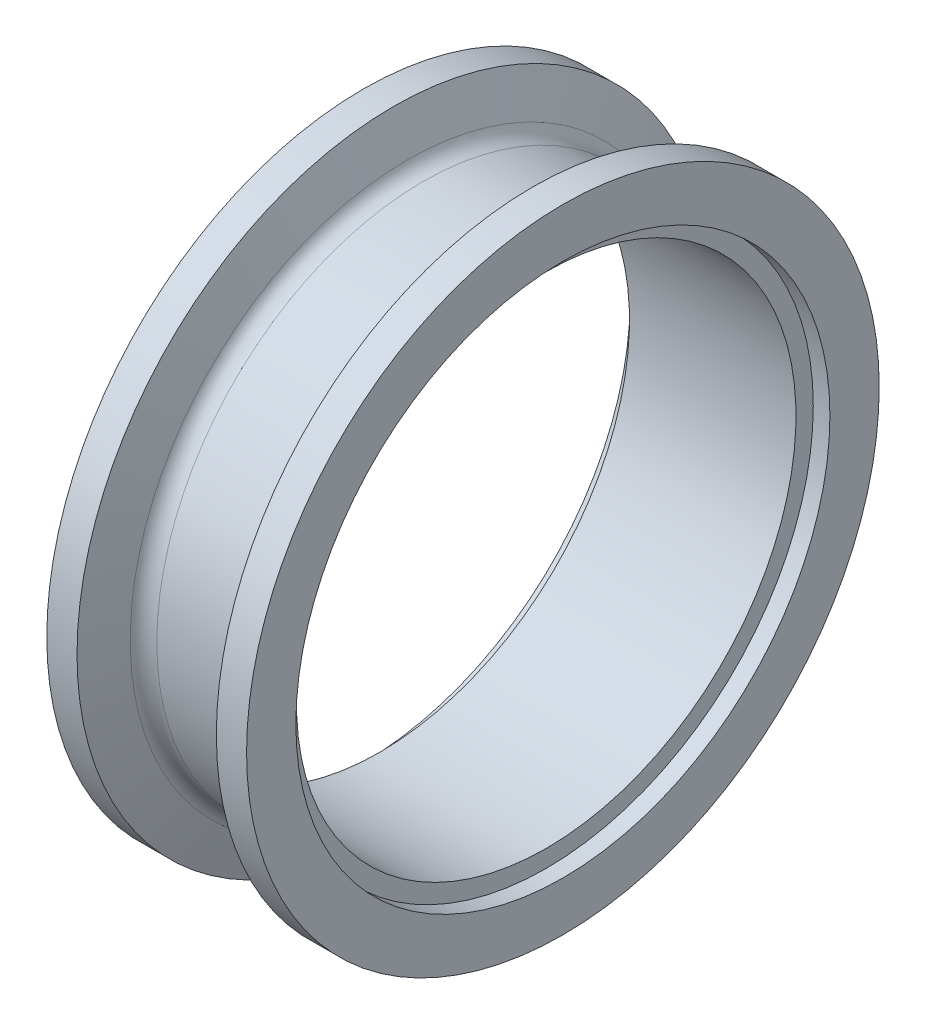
from build123d import *


with BuildPart() as part:
    # Sketch1 → Revolve1 (revolve)
    with BuildSketch(Plane.XY):
        with BuildLine():
            Line((0, 60.325), (5.7658, 60.325))
            Line((5.7658, 60.325), (8.472251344, 52.889086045))
            ThreePointArc((8.472251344, 52.889086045), (9.63467023, 51.374192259), (11.455775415, 50.8))
            Line((11.455775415, 50.8), (26.644224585, 50.8))
            ThreePointArc((26.644224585, 50.8), (28.46532977, 51.374192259), (29.627748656, 52.889086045))
            Line((29.627748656, 52.889086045), (32.3342, 60.325))
            Line((32.3342, 60.325), (38.1, 60.325))
            Line((38.1, 60.325), (38.1, 50.927))
            Line((38.1, 50.927), (34.925, 50.927))
            Line((34.925, 50.927), (34.925, 47.625))
            Line((34.925, 47.625), (3.175, 47.625))
            Line((3.175, 47.625), (3.175, 50.927))
            Line((3.175, 50.927), (0, 50.927))
            Line((0, 50.927), (0, 60.325))
        make_face()
    revolve(axis=Axis((19.05, 0, 0), (-1, 0, 0)))


solid = part.part
